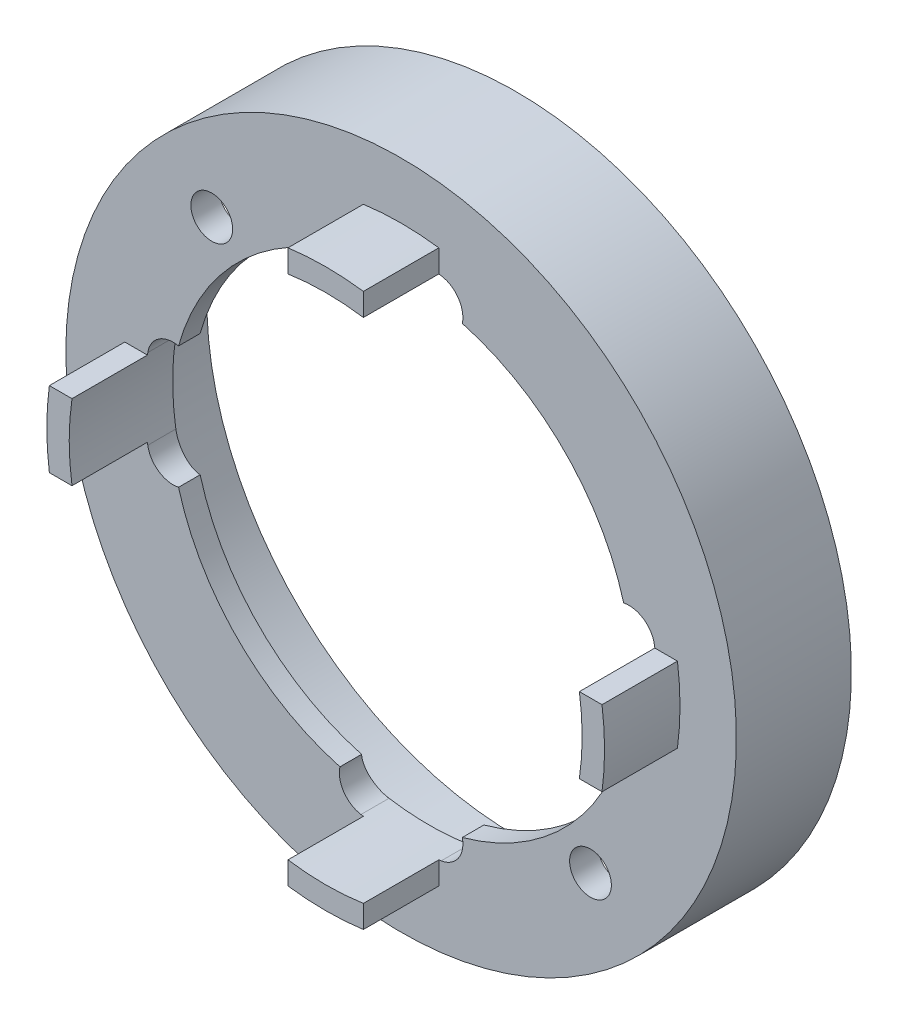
from build123d import *

# Parameters (mm, degrees)
SKETCH1_R           = 22.225
BOSS_EXTRUDE1_DEPTH = 7.62
CUT_EXTRUDE1_REACH  = 34.341
SKETCH2_R           = 15.3
BOSS_EXTRUDE2_DEPTH = 5
CUT_EXTRUDE2_REACH  = 34.341
CIRPATTERN1_COUNT   = 4
SKETCH6_R           = 1.3843
CUT_EXTRUDE3_DEPTH  = 3


with BuildPart() as part:
    # Sketch1 → Boss-Extrude1 (new body)
    with BuildSketch(Plane.XY):
        with Locations(Location((0, 0, 0), (0, 0, 180))):
            Circle(SKETCH1_R)
    extrude(amount=BOSS_EXTRUDE1_DEPTH)

    # Sketch2 → Cut-Extrude1 (cut, up to next)
    with BuildSketch(Plane.XY.offset(7.62), mode=Mode.PRIVATE) as cut_extrude1_sk1:
        Circle(SKETCH2_R)
    cut_extrude1_tool1 = extrude(cut_extrude1_sk1.sketch, amount=-CUT_EXTRUDE1_REACH, mode=Mode.PRIVATE) & part.part
    add(cut_extrude1_tool1.solids().sort_by_distance((0, 0, 7.62))[0], mode=Mode.SUBTRACT)

    # Sketch3 → Cut-Revolve1 (revolve, cut)
    with BuildSketch(Plane(origin=(0, 0, 0), x_dir=(1, 0, 0), z_dir=(0, 1, 0)), mode=Mode.PRIVATE) as cut_revolve1_sk:
        Polygon((-17, -5.761288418), (-20.5, -5.761288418), (-20.5, 0), (-15, 0), (-15, -6.262911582), align=None)
    revolve(cut_revolve1_sk.sketch.rotate(Axis((0, 0, -1.424421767), (0, 0, -1)), 180), axis=Axis((0, 0, -1.424421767), (0, 0, -1)), mode=Mode.SUBTRACT)

    # Sketch4 → Boss-Extrude2 (add)
    with BuildSketch(Plane.XY.offset(7.62)):
        with BuildLine():
            Line((-16.815171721, 2.5), (-18.315171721, 2.5))
            ThreePointArc((-18.315171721, 2.5), (-18.485007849, 0), (-18.315171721, -2.5))
            Line((-18.315171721, -2.5), (-16.815171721, -2.5))
            ThreePointArc((-16.815171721, -2.5), (-17, 0), (-16.815171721, 2.5))
        make_face()
    boss_extrude2 = extrude(amount=BOSS_EXTRUDE2_DEPTH)

    # Cut-Extrude2: up to this cone (the profile starts outside it)
    cut_extrude2_end = Plane(origin=(0, 0, 7.62), z_dir=(0, 0, -1)).offset(-2.405084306) * Cone(3.987e-06, 186.73498454, 46.835295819, align=(Align.CENTER, Align.CENTER, Align.MIN), mode=Mode.PRIVATE)
    # Sketch5 → Cut-Extrude2 (cut, up to the surface)
    with BuildSketch(Plane.XY.offset(7.62), mode=Mode.PRIVATE) as cut_extrude2_sk1:
        with BuildLine():
            ThreePointArc((-16.79070179, 2.659385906), (-17, 0), (-16.79070179, -2.659385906))
            ThreePointArc((-16.79070179, -2.659385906), (-14.845693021, -4.072517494), (-13.432561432, -2.127508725))
            ThreePointArc((-13.432561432, -2.127508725), (-13.6, 0), (-13.432561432, 2.127508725))
            ThreePointArc((-13.432561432, 2.127508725), (-14.845693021, 4.072517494), (-16.79070179, 2.659385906))
        make_face()
    cut_extrude2_tool1 = extrude(cut_extrude2_sk1.sketch, amount=-CUT_EXTRUDE2_REACH, mode=Mode.PRIVATE) - cut_extrude2_end
    cut_extrude2 = cut_extrude2_tool1.solids().sort_by_distance((-15.192328, 0, 7.62))[0]
    add(cut_extrude2, mode=Mode.SUBTRACT)

    # CirPattern1: Boss-Extrude2, Cut-Extrude2 ×4 about axis
    cirpattern1_axis = Axis((0, 0, 0), (0, 0, 1))
    add([boss_extrude2.rotate(cirpattern1_axis, i * 360 / CIRPATTERN1_COUNT) for i in range(1, CIRPATTERN1_COUNT)])
    add([cut_extrude2.rotate(cirpattern1_axis, i * 360 / CIRPATTERN1_COUNT) for i in range(1, CIRPATTERN1_COUNT)], mode=Mode.SUBTRACT)

    # Sketch6 → Cut-Extrude3 (cut)
    with BuildSketch(Plane(origin=(0, 0, 5.761288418), x_dir=(-1, 0, 0), z_dir=(0, 0, -1))):
        with Locations(Location((-12.551145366, -12.551145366, 0), (0, 0, 349.704087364))):
            Circle(SKETCH6_R)
        with Locations(Location((12.551145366, 12.551145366, 0), (0, 0, 280.29591268))):
            Circle(SKETCH6_R)
    extrude(amount=-CUT_EXTRUDE3_DEPTH, mode=Mode.SUBTRACT)


solid = part.part
